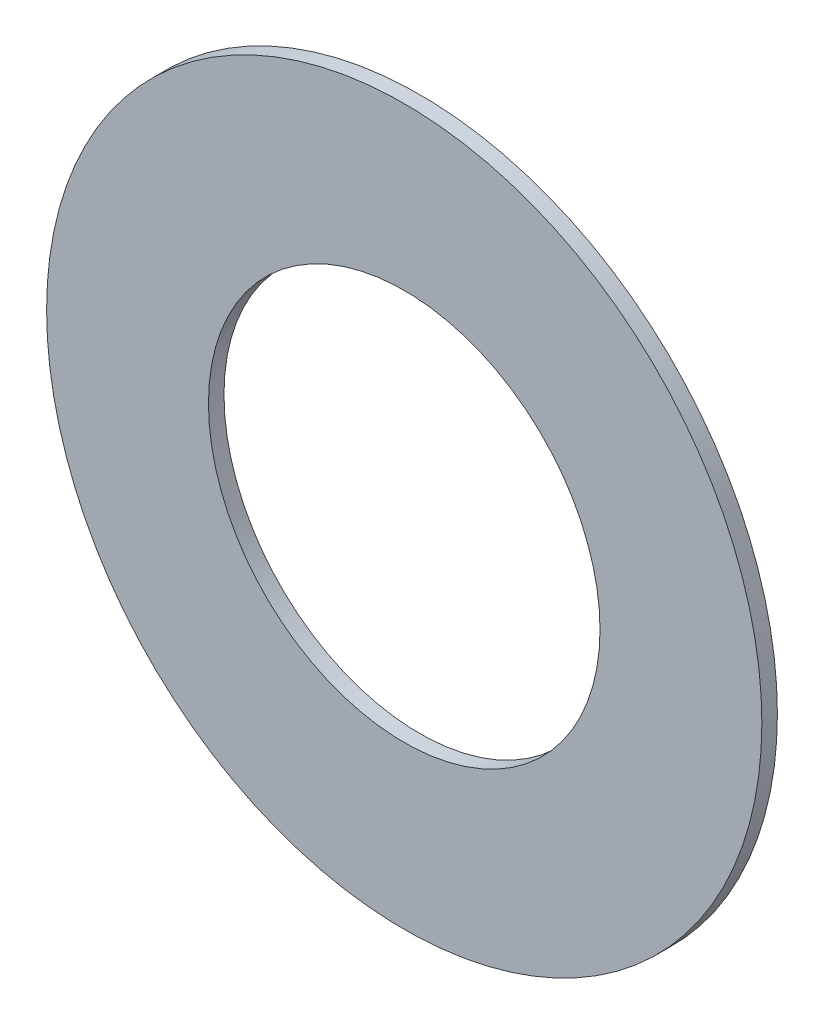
ISO-10303-21;
HEADER;
FILE_DESCRIPTION(('STEP AP214'),'2;1');
FILE_NAME('part.step','',(''),(''),'','','');
FILE_SCHEMA(('AUTOMOTIVE_DESIGN { 1 0 10303 214 1 1 1 1 }'));
ENDSEC;
DATA;
#1=APPLICATION_CONTEXT('core data for automotive mechanical design processes');
#2=APPLICATION_PROTOCOL_DEFINITION('international standard','automotive_design',2000,#1);
#3=PRODUCT_CONTEXT('',#1,'mechanical');
#4=PRODUCT('Part','Part','',(#3));
#5=PRODUCT_RELATED_PRODUCT_CATEGORY('part','',(#4));
#6=PRODUCT_DEFINITION_FORMATION('','',#4);
#7=PRODUCT_DEFINITION_CONTEXT('part definition',#1,'design');
#8=PRODUCT_DEFINITION('design','',#6,#7);
#9=PRODUCT_DEFINITION_SHAPE('','',#8);
#10=(LENGTH_UNIT() NAMED_UNIT(*) SI_UNIT(.MILLI.,.METRE.));
#11=(NAMED_UNIT(*) PLANE_ANGLE_UNIT() SI_UNIT($,.RADIAN.));
#12=(NAMED_UNIT(*) SI_UNIT($,.STERADIAN.) SOLID_ANGLE_UNIT());
#13=UNCERTAINTY_MEASURE_WITH_UNIT(LENGTH_MEASURE(1.E-05),#10,'distance_accuracy_value','');
#14=(GEOMETRIC_REPRESENTATION_CONTEXT(3) GLOBAL_UNCERTAINTY_ASSIGNED_CONTEXT((#13)) GLOBAL_UNIT_ASSIGNED_CONTEXT((#10,
#11,#12)) REPRESENTATION_CONTEXT('',''));
#15=CARTESIAN_POINT('',(0.,0.,0.));
#16=DIRECTION('',(0.,0.,1.));
#17=DIRECTION('',(1.,0.,0.));
#18=AXIS2_PLACEMENT_3D('',#15,#16,#17);
#19=CARTESIAN_POINT('',(0.,0.,1.5875));
#20=DIRECTION('',(0.,0.,1.));
#21=DIRECTION('',(1.,0.,0.));
#22=AXIS2_PLACEMENT_3D('',#19,#20,#21);
#23=PLANE('',#22);
#24=CARTESIAN_POINT('',(0.,0.,1.5875));
#25=DIRECTION('',(0.,0.,1.));
#26=DIRECTION('',(1.,0.,0.));
#27=AXIS2_PLACEMENT_3D('',#24,#25,#26);
#28=CIRCLE('',#27,73.0743706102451);
#29=CARTESIAN_POINT('',(73.0743706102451,0.,1.5875));
#30=VERTEX_POINT('',#29);
#31=EDGE_CURVE('E10',#30,#30,#28,.T.);
#32=ORIENTED_EDGE('',*,*,#31,.T.);
#33=EDGE_LOOP('',(#32));
#34=FACE_BOUND('',#33,.T.);
#35=CARTESIAN_POINT('',(0.,0.,1.5875));
#36=DIRECTION('',(0.,0.,1.));
#37=DIRECTION('',(1.,0.,0.));
#38=AXIS2_PLACEMENT_3D('',#35,#36,#37);
#39=CIRCLE('',#38,40.005);
#40=CARTESIAN_POINT('',(40.005,0.,1.5875));
#41=VERTEX_POINT('',#40);
#42=EDGE_CURVE('E55',#41,#41,#39,.T.);
#43=ORIENTED_EDGE('',*,*,#42,.F.);
#44=EDGE_LOOP('',(#43));
#45=FACE_BOUND('',#44,.T.);
#46=ADVANCED_FACE('F41',(#34,#45),#23,.T.);
#47=CARTESIAN_POINT('',(0.,0.,-1.5875));
#48=DIRECTION('',(0.,0.,1.));
#49=DIRECTION('',(1.,0.,0.));
#50=AXIS2_PLACEMENT_3D('',#47,#48,#49);
#51=PLANE('',#50);
#52=CARTESIAN_POINT('',(0.,0.,-1.5875));
#53=DIRECTION('',(0.,0.,1.));
#54=DIRECTION('',(1.,0.,0.));
#55=AXIS2_PLACEMENT_3D('',#52,#53,#54);
#56=CIRCLE('',#55,73.0743706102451);
#57=CARTESIAN_POINT('',(73.0743706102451,0.,-1.5875));
#58=VERTEX_POINT('',#57);
#59=EDGE_CURVE('E44',#58,#58,#56,.T.);
#60=ORIENTED_EDGE('',*,*,#59,.F.);
#61=EDGE_LOOP('',(#60));
#62=FACE_BOUND('',#61,.T.);
#63=CARTESIAN_POINT('',(0.,0.,-1.5875));
#64=DIRECTION('',(0.,0.,1.));
#65=DIRECTION('',(1.,0.,0.));
#66=AXIS2_PLACEMENT_3D('',#63,#64,#65);
#67=CIRCLE('',#66,40.005);
#68=CARTESIAN_POINT('',(40.005,0.,-1.5875));
#69=VERTEX_POINT('',#68);
#70=EDGE_CURVE('E53',#69,#69,#67,.T.);
#71=ORIENTED_EDGE('',*,*,#70,.T.);
#72=EDGE_LOOP('',(#71));
#73=FACE_BOUND('',#72,.T.);
#74=ADVANCED_FACE('F61',(#62,#73),#51,.F.);
#75=CARTESIAN_POINT('',(0.,0.,1.5875));
#76=DIRECTION('',(0.,0.,-1.));
#77=DIRECTION('',(-1.,0.,0.));
#78=AXIS2_PLACEMENT_3D('',#75,#76,#77);
#79=CYLINDRICAL_SURFACE('',#78,73.0743706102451);
#80=ORIENTED_EDGE('',*,*,#31,.F.);
#81=EDGE_LOOP('',(#80));
#82=FACE_BOUND('',#81,.T.);
#83=ORIENTED_EDGE('',*,*,#59,.T.);
#84=EDGE_LOOP('',(#83));
#85=FACE_BOUND('',#84,.T.);
#86=ADVANCED_FACE('F43',(#82,#85),#79,.T.);
#87=CARTESIAN_POINT('',(0.,0.,1.5875));
#88=DIRECTION('',(0.,0.,-1.));
#89=DIRECTION('',(-1.,0.,0.));
#90=AXIS2_PLACEMENT_3D('',#87,#88,#89);
#91=CYLINDRICAL_SURFACE('',#90,40.005);
#92=ORIENTED_EDGE('',*,*,#42,.T.);
#93=EDGE_LOOP('',(#92));
#94=FACE_BOUND('',#93,.T.);
#95=ORIENTED_EDGE('',*,*,#70,.F.);
#96=EDGE_LOOP('',(#95));
#97=FACE_BOUND('',#96,.T.);
#98=ADVANCED_FACE('F58',(#94,#97),#91,.F.);
#99=CLOSED_SHELL('',(#46,#74,#86,#98));
#100=MANIFOLD_SOLID_BREP('B2',#99);
#101=ADVANCED_BREP_SHAPE_REPRESENTATION('',(#18,#100),#14);
#102=SHAPE_DEFINITION_REPRESENTATION(#9,#101);
ENDSEC;
END-ISO-10303-21;
